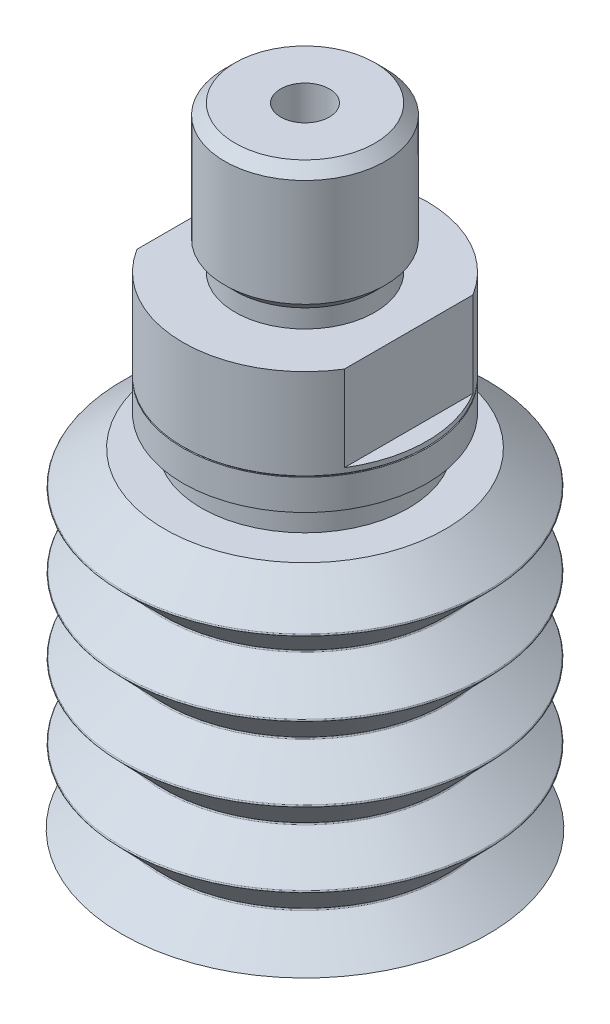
ISO-10303-21;
HEADER;
FILE_DESCRIPTION(('STEP AP214'),'2;1');
FILE_NAME('part.step','',(''),(''),'','','');
FILE_SCHEMA(('AUTOMOTIVE_DESIGN { 1 0 10303 214 1 1 1 1 }'));
ENDSEC;
DATA;
#1=APPLICATION_CONTEXT('core data for automotive mechanical design processes');
#2=APPLICATION_PROTOCOL_DEFINITION('international standard','automotive_design',2000,#1);
#3=PRODUCT_CONTEXT('',#1,'mechanical');
#4=PRODUCT('Part','Part','',(#3));
#5=PRODUCT_RELATED_PRODUCT_CATEGORY('part','',(#4));
#6=PRODUCT_DEFINITION_FORMATION('','',#4);
#7=PRODUCT_DEFINITION_CONTEXT('part definition',#1,'design');
#8=PRODUCT_DEFINITION('design','',#6,#7);
#9=PRODUCT_DEFINITION_SHAPE('','',#8);
#10=(LENGTH_UNIT() NAMED_UNIT(*) SI_UNIT(.MILLI.,.METRE.));
#11=(NAMED_UNIT(*) PLANE_ANGLE_UNIT() SI_UNIT($,.RADIAN.));
#12=(NAMED_UNIT(*) SI_UNIT($,.STERADIAN.) SOLID_ANGLE_UNIT());
#13=UNCERTAINTY_MEASURE_WITH_UNIT(LENGTH_MEASURE(1.E-05),#10,'distance_accuracy_value','');
#14=(GEOMETRIC_REPRESENTATION_CONTEXT(3) GLOBAL_UNCERTAINTY_ASSIGNED_CONTEXT((#13)) GLOBAL_UNIT_ASSIGNED_CONTEXT((#10,
#11,#12)) REPRESENTATION_CONTEXT('',''));
#15=CARTESIAN_POINT('',(0.,0.,0.));
#16=DIRECTION('',(0.,0.,1.));
#17=DIRECTION('',(1.,0.,0.));
#18=AXIS2_PLACEMENT_3D('',#15,#16,#17);
#19=CARTESIAN_POINT('',(-8.5,39.5,-12.));
#20=DIRECTION('',(1.,0.,0.));
#21=DIRECTION('',(0.,1.,0.));
#22=AXIS2_PLACEMENT_3D('',#19,#20,#21);
#23=PLANE('',#22);
#24=DIRECTION('',(0.,1.,0.));
#25=VECTOR('',#24,1.);
#26=CARTESIAN_POINT('',(-8.5,32.,5.26782687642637));
#27=LINE('',#26,#25);
#28=CARTESIAN_POINT('',(-8.5,32.5,5.26782687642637));
#29=VERTEX_POINT('',#28);
#30=CARTESIAN_POINT('',(-8.5,39.5,5.26782687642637));
#31=VERTEX_POINT('',#30);
#32=EDGE_CURVE('E336',#29,#31,#27,.T.);
#33=ORIENTED_EDGE('',*,*,#32,.T.);
#34=DIRECTION('',(0.,0.,-1.));
#35=VECTOR('',#34,1.);
#36=CARTESIAN_POINT('',(-8.5,39.5,0.));
#37=LINE('',#36,#35);
#38=CARTESIAN_POINT('',(-8.5,39.5,-5.26782687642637));
#39=VERTEX_POINT('',#38);
#40=EDGE_CURVE('E381',#31,#39,#37,.T.);
#41=ORIENTED_EDGE('',*,*,#40,.T.);
#42=DIRECTION('',(0.,-1.,0.));
#43=VECTOR('',#42,1.);
#44=CARTESIAN_POINT('',(-8.5,32.,-5.26782687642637));
#45=LINE('',#44,#43);
#46=CARTESIAN_POINT('',(-8.5,32.5,-5.26782687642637));
#47=VERTEX_POINT('',#46);
#48=EDGE_CURVE('E359',#39,#47,#45,.T.);
#49=ORIENTED_EDGE('',*,*,#48,.T.);
#50=DIRECTION('',(0.,0.,1.));
#51=VECTOR('',#50,1.);
#52=CARTESIAN_POINT('',(-8.5,32.5,-12.));
#53=LINE('',#52,#51);
#54=EDGE_CURVE('E10',#47,#29,#53,.T.);
#55=ORIENTED_EDGE('',*,*,#54,.T.);
#56=EDGE_LOOP('',(#33,#41,#49,#55));
#57=FACE_BOUND('',#56,.T.);
#58=ADVANCED_FACE('F16',(#57),#23,.F.);
#59=CARTESIAN_POINT('',(0.,32.5,0.));
#60=DIRECTION('',(0.,1.,0.));
#61=DIRECTION('',(1.,0.,0.));
#62=AXIS2_PLACEMENT_3D('',#59,#60,#61);
#63=PLANE('',#62);
#64=ORIENTED_EDGE('',*,*,#54,.F.);
#65=CARTESIAN_POINT('',(0.,32.5,0.));
#66=DIRECTION('',(0.,-1.,0.));
#67=DIRECTION('',(0.,0.,1.));
#68=AXIS2_PLACEMENT_3D('',#65,#66,#67);
#69=CIRCLE('',#68,10.);
#70=EDGE_CURVE('E340',#29,#47,#69,.T.);
#71=ORIENTED_EDGE('',*,*,#70,.F.);
#72=EDGE_LOOP('',(#64,#71));
#73=FACE_BOUND('',#72,.T.);
#74=ADVANCED_FACE('F525',(#73),#63,.T.);
#75=CARTESIAN_POINT('',(0.,32.5,0.));
#76=DIRECTION('',(0.,1.,0.));
#77=DIRECTION('',(1.,0.,0.));
#78=AXIS2_PLACEMENT_3D('',#75,#76,#77);
#79=PLANE('',#78);
#80=DIRECTION('',(0.,0.,-1.));
#81=VECTOR('',#80,1.);
#82=CARTESIAN_POINT('',(8.5,32.5,12.));
#83=LINE('',#82,#81);
#84=CARTESIAN_POINT('',(8.5,32.5,5.26782687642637));
#85=VERTEX_POINT('',#84);
#86=CARTESIAN_POINT('',(8.5,32.5,-5.26782687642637));
#87=VERTEX_POINT('',#86);
#88=EDGE_CURVE('E26',#85,#87,#83,.T.);
#89=ORIENTED_EDGE('',*,*,#88,.F.);
#90=CARTESIAN_POINT('',(0.,32.5,0.));
#91=DIRECTION('',(0.,-1.,0.));
#92=DIRECTION('',(0.,0.,1.));
#93=AXIS2_PLACEMENT_3D('',#90,#91,#92);
#94=CIRCLE('',#93,10.);
#95=EDGE_CURVE('E314',#87,#85,#94,.T.);
#96=ORIENTED_EDGE('',*,*,#95,.F.);
#97=EDGE_LOOP('',(#89,#96));
#98=FACE_BOUND('',#97,.T.);
#99=ADVANCED_FACE('F530',(#98),#79,.T.);
#100=CARTESIAN_POINT('',(8.5,39.5,12.));
#101=DIRECTION('',(-1.,0.,0.));
#102=DIRECTION('',(0.,0.,1.));
#103=AXIS2_PLACEMENT_3D('',#100,#101,#102);
#104=PLANE('',#103);
#105=DIRECTION('',(0.,1.,0.));
#106=VECTOR('',#105,1.);
#107=CARTESIAN_POINT('',(8.5,32.,-5.26782687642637));
#108=LINE('',#107,#106);
#109=CARTESIAN_POINT('',(8.5,39.5,-5.26782687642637));
#110=VERTEX_POINT('',#109);
#111=EDGE_CURVE('E384',#87,#110,#108,.T.);
#112=ORIENTED_EDGE('',*,*,#111,.T.);
#113=DIRECTION('',(0.,0.,1.));
#114=VECTOR('',#113,1.);
#115=CARTESIAN_POINT('',(8.5,39.5,0.));
#116=LINE('',#115,#114);
#117=CARTESIAN_POINT('',(8.5,39.5,5.26782687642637));
#118=VERTEX_POINT('',#117);
#119=EDGE_CURVE('E291',#110,#118,#116,.T.);
#120=ORIENTED_EDGE('',*,*,#119,.T.);
#121=DIRECTION('',(0.,-1.,0.));
#122=VECTOR('',#121,1.);
#123=CARTESIAN_POINT('',(8.5,32.,5.26782687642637));
#124=LINE('',#123,#122);
#125=EDGE_CURVE('E309',#118,#85,#124,.T.);
#126=ORIENTED_EDGE('',*,*,#125,.T.);
#127=ORIENTED_EDGE('',*,*,#88,.T.);
#128=EDGE_LOOP('',(#112,#120,#126,#127));
#129=FACE_BOUND('',#128,.T.);
#130=ADVANCED_FACE('F614',(#129),#104,.F.);
#131=CARTESIAN_POINT('',(0.,50.644,0.));
#132=DIRECTION('',(0.,-1.,0.));
#133=DIRECTION('',(0.,0.,-1.));
#134=AXIS2_PLACEMENT_3D('',#131,#132,#133);
#135=CONICAL_SURFACE('',#134,6.5785,0.785398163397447);
#136=CARTESIAN_POINT('',(0.,50.644,0.));
#137=DIRECTION('',(0.,-1.,0.));
#138=DIRECTION('',(0.,0.,-1.));
#139=AXIS2_PLACEMENT_3D('',#136,#137,#138);
#140=CIRCLE('',#139,6.5785);
#141=CARTESIAN_POINT('',(0.,50.644,-6.5785));
#142=VERTEX_POINT('',#141);
#143=EDGE_CURVE('E38',#142,#142,#140,.T.);
#144=ORIENTED_EDGE('',*,*,#143,.F.);
#145=EDGE_LOOP('',(#144));
#146=FACE_BOUND('',#145,.T.);
#147=CARTESIAN_POINT('',(0.,51.5,0.));
#148=DIRECTION('',(0.,-1.,0.));
#149=DIRECTION('',(0.,0.,-1.));
#150=AXIS2_PLACEMENT_3D('',#147,#148,#149);
#151=CIRCLE('',#150,5.7225);
#152=CARTESIAN_POINT('',(0.,51.5,-5.7225));
#153=VERTEX_POINT('',#152);
#154=EDGE_CURVE('E370',#153,#153,#151,.T.);
#155=ORIENTED_EDGE('',*,*,#154,.T.);
#156=EDGE_LOOP('',(#155));
#157=FACE_BOUND('',#156,.T.);
#158=ADVANCED_FACE('F616',(#146,#157),#135,.T.);
#159=CARTESIAN_POINT('',(0.,32.,0.));
#160=DIRECTION('',(0.,-1.,0.));
#161=DIRECTION('',(0.,0.,-1.));
#162=AXIS2_PLACEMENT_3D('',#159,#160,#161);
#163=CYLINDRICAL_SURFACE('',#162,6.5785);
#164=CARTESIAN_POINT('',(0.,41.856,0.));
#165=DIRECTION('',(0.,-1.,0.));
#166=DIRECTION('',(0.,0.,-1.));
#167=AXIS2_PLACEMENT_3D('',#164,#165,#166);
#168=CIRCLE('',#167,6.5785);
#169=CARTESIAN_POINT('',(0.,41.856,-6.5785));
#170=VERTEX_POINT('',#169);
#171=EDGE_CURVE('E290',#170,#170,#168,.T.);
#172=ORIENTED_EDGE('',*,*,#171,.F.);
#173=EDGE_LOOP('',(#172));
#174=FACE_BOUND('',#173,.T.);
#175=ORIENTED_EDGE('',*,*,#143,.T.);
#176=EDGE_LOOP('',(#175));
#177=FACE_BOUND('',#176,.T.);
#178=ADVANCED_FACE('F620',(#174,#177),#163,.T.);
#179=CARTESIAN_POINT('',(0.,41.,0.));
#180=DIRECTION('',(0.,1.,0.));
#181=DIRECTION('',(0.,0.,1.));
#182=AXIS2_PLACEMENT_3D('',#179,#180,#181);
#183=CONICAL_SURFACE('',#182,5.7225,0.785398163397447);
#184=CARTESIAN_POINT('',(0.,41.,0.));
#185=DIRECTION('',(0.,-1.,0.));
#186=DIRECTION('',(0.,0.,-1.));
#187=AXIS2_PLACEMENT_3D('',#184,#185,#186);
#188=CIRCLE('',#187,5.7225);
#189=CARTESIAN_POINT('',(0.,41.,-5.7225));
#190=VERTEX_POINT('',#189);
#191=EDGE_CURVE('E78',#190,#190,#188,.T.);
#192=ORIENTED_EDGE('',*,*,#191,.F.);
#193=EDGE_LOOP('',(#192));
#194=FACE_BOUND('',#193,.T.);
#195=ORIENTED_EDGE('',*,*,#171,.T.);
#196=EDGE_LOOP('',(#195));
#197=FACE_BOUND('',#196,.T.);
#198=ADVANCED_FACE('F587',(#194,#197),#183,.T.);
#199=CARTESIAN_POINT('',(0.,32.,0.));
#200=DIRECTION('',(0.,-1.,0.));
#201=DIRECTION('',(0.,0.,-1.));
#202=AXIS2_PLACEMENT_3D('',#199,#200,#201);
#203=CYLINDRICAL_SURFACE('',#202,5.7225);
#204=CARTESIAN_POINT('',(0.,39.5,0.));
#205=DIRECTION('',(0.,-1.,0.));
#206=DIRECTION('',(0.,0.,-1.));
#207=AXIS2_PLACEMENT_3D('',#204,#205,#206);
#208=CIRCLE('',#207,5.7225);
#209=CARTESIAN_POINT('',(0.,39.5,-5.7225));
#210=VERTEX_POINT('',#209);
#211=EDGE_CURVE('E88',#210,#210,#208,.T.);
#212=ORIENTED_EDGE('',*,*,#211,.F.);
#213=EDGE_LOOP('',(#212));
#214=FACE_BOUND('',#213,.T.);
#215=ORIENTED_EDGE('',*,*,#191,.T.);
#216=EDGE_LOOP('',(#215));
#217=FACE_BOUND('',#216,.T.);
#218=ADVANCED_FACE('F584',(#214,#217),#203,.T.);
#219=CARTESIAN_POINT('',(10.,39.5,0.));
#220=DIRECTION('',(0.,1.,0.));
#221=DIRECTION('',(1.,0.,0.));
#222=AXIS2_PLACEMENT_3D('',#219,#220,#221);
#223=PLANE('',#222);
#224=ORIENTED_EDGE('',*,*,#40,.F.);
#225=CARTESIAN_POINT('',(0.,39.5,0.));
#226=DIRECTION('',(0.,-1.,0.));
#227=DIRECTION('',(0.,0.,-1.));
#228=AXIS2_PLACEMENT_3D('',#225,#226,#227);
#229=CIRCLE('',#228,10.);
#230=EDGE_CURVE('E313',#118,#31,#229,.T.);
#231=ORIENTED_EDGE('',*,*,#230,.F.);
#232=ORIENTED_EDGE('',*,*,#119,.F.);
#233=CARTESIAN_POINT('',(0.,39.5,0.));
#234=DIRECTION('',(0.,-1.,0.));
#235=DIRECTION('',(0.,0.,-1.));
#236=AXIS2_PLACEMENT_3D('',#233,#234,#235);
#237=CIRCLE('',#236,10.);
#238=EDGE_CURVE('E363',#39,#110,#237,.T.);
#239=ORIENTED_EDGE('',*,*,#238,.F.);
#240=EDGE_LOOP('',(#224,#231,#232,#239));
#241=FACE_BOUND('',#240,.T.);
#242=ORIENTED_EDGE('',*,*,#211,.T.);
#243=EDGE_LOOP('',(#242));
#244=FACE_BOUND('',#243,.T.);
#245=ADVANCED_FACE('F544',(#241,#244),#223,.T.);
#246=CARTESIAN_POINT('',(0.,32.,0.));
#247=DIRECTION('',(0.,-1.,0.));
#248=DIRECTION('',(0.,0.,-1.));
#249=AXIS2_PLACEMENT_3D('',#246,#247,#248);
#250=CYLINDRICAL_SURFACE('',#249,10.);
#251=CARTESIAN_POINT('',(0.,32.1,0.));
#252=DIRECTION('',(0.,-1.,0.));
#253=DIRECTION('',(0.,0.,-1.));
#254=AXIS2_PLACEMENT_3D('',#251,#252,#253);
#255=CIRCLE('',#254,10.);
#256=CARTESIAN_POINT('',(0.,32.1,-10.));
#257=VERTEX_POINT('',#256);
#258=EDGE_CURVE('E388',#257,#257,#255,.T.);
#259=ORIENTED_EDGE('',*,*,#258,.F.);
#260=EDGE_LOOP('',(#259));
#261=FACE_BOUND('',#260,.T.);
#262=ORIENTED_EDGE('',*,*,#111,.F.);
#263=ORIENTED_EDGE('',*,*,#95,.T.);
#264=ORIENTED_EDGE('',*,*,#125,.F.);
#265=ORIENTED_EDGE('',*,*,#230,.T.);
#266=ORIENTED_EDGE('',*,*,#32,.F.);
#267=ORIENTED_EDGE('',*,*,#70,.T.);
#268=ORIENTED_EDGE('',*,*,#48,.F.);
#269=ORIENTED_EDGE('',*,*,#238,.T.);
#270=EDGE_LOOP('',(#262,#263,#264,#265,#266,#267,#268,#269));
#271=FACE_BOUND('',#270,.T.);
#272=ADVANCED_FACE('F541',(#261,#271),#250,.T.);
#273=CARTESIAN_POINT('',(0.,32.,0.));
#274=DIRECTION('',(0.,1.,0.));
#275=DIRECTION('',(0.,0.,1.));
#276=AXIS2_PLACEMENT_3D('',#273,#274,#275);
#277=CONICAL_SURFACE('',#276,9.9,0.785398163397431);
#278=CARTESIAN_POINT('',(0.,32.,0.));
#279=DIRECTION('',(0.,-1.,0.));
#280=DIRECTION('',(0.,0.,-1.));
#281=AXIS2_PLACEMENT_3D('',#278,#279,#280);
#282=CIRCLE('',#281,9.9);
#283=CARTESIAN_POINT('',(0.,32.,-9.9));
#284=VERTEX_POINT('',#283);
#285=EDGE_CURVE('E305',#284,#284,#282,.T.);
#286=ORIENTED_EDGE('',*,*,#285,.F.);
#287=EDGE_LOOP('',(#286));
#288=FACE_BOUND('',#287,.T.);
#289=ORIENTED_EDGE('',*,*,#258,.T.);
#290=EDGE_LOOP('',(#289));
#291=FACE_BOUND('',#290,.T.);
#292=ADVANCED_FACE('F660',(#288,#291),#277,.T.);
#293=CARTESIAN_POINT('',(0.,32.,0.));
#294=DIRECTION('',(0.,-1.,0.));
#295=DIRECTION('',(0.,0.,-1.));
#296=AXIS2_PLACEMENT_3D('',#293,#294,#295);
#297=CYLINDRICAL_SURFACE('',#296,2.);
#298=CARTESIAN_POINT('',(0.,51.5,0.));
#299=DIRECTION('',(0.,-1.,0.));
#300=DIRECTION('',(0.,0.,-1.));
#301=AXIS2_PLACEMENT_3D('',#298,#299,#300);
#302=CIRCLE('',#301,2.);
#303=CARTESIAN_POINT('',(0.,51.5,-2.));
#304=VERTEX_POINT('',#303);
#305=EDGE_CURVE('E331',#304,#304,#302,.T.);
#306=ORIENTED_EDGE('',*,*,#305,.F.);
#307=EDGE_LOOP('',(#306));
#308=FACE_BOUND('',#307,.T.);
#309=CARTESIAN_POINT('',(0.,32.,0.));
#310=DIRECTION('',(0.,-1.,0.));
#311=DIRECTION('',(0.,0.,-1.));
#312=AXIS2_PLACEMENT_3D('',#309,#310,#311);
#313=CIRCLE('',#312,2.);
#314=CARTESIAN_POINT('',(0.,32.,-2.));
#315=VERTEX_POINT('',#314);
#316=EDGE_CURVE('E328',#315,#315,#313,.T.);
#317=ORIENTED_EDGE('',*,*,#316,.T.);
#318=EDGE_LOOP('',(#317));
#319=FACE_BOUND('',#318,.T.);
#320=ADVANCED_FACE('F663',(#308,#319),#297,.F.);
#321=CARTESIAN_POINT('',(5.7225,51.5,0.));
#322=DIRECTION('',(0.,1.,0.));
#323=DIRECTION('',(1.,0.,0.));
#324=AXIS2_PLACEMENT_3D('',#321,#322,#323);
#325=PLANE('',#324);
#326=ORIENTED_EDGE('',*,*,#154,.F.);
#327=EDGE_LOOP('',(#326));
#328=FACE_BOUND('',#327,.T.);
#329=ORIENTED_EDGE('',*,*,#305,.T.);
#330=EDGE_LOOP('',(#329));
#331=FACE_BOUND('',#330,.T.);
#332=ADVANCED_FACE('F643',(#328,#331),#325,.T.);
#333=CARTESIAN_POINT('',(2.,32.,0.));
#334=DIRECTION('',(0.,-1.,0.));
#335=DIRECTION('',(0.,0.,-1.));
#336=AXIS2_PLACEMENT_3D('',#333,#334,#335);
#337=PLANE('',#336);
#338=ORIENTED_EDGE('',*,*,#316,.F.);
#339=EDGE_LOOP('',(#338));
#340=FACE_BOUND('',#339,.T.);
#341=CARTESIAN_POINT('',(0.,32.,0.));
#342=DIRECTION('',(0.,-1.,0.));
#343=DIRECTION('',(0.,0.,-1.));
#344=AXIS2_PLACEMENT_3D('',#341,#342,#343);
#345=CIRCLE('',#344,3.25);
#346=CARTESIAN_POINT('',(0.,32.,-3.25));
#347=VERTEX_POINT('',#346);
#348=EDGE_CURVE('E308',#347,#347,#345,.T.);
#349=ORIENTED_EDGE('',*,*,#348,.T.);
#350=EDGE_LOOP('',(#349));
#351=FACE_BOUND('',#350,.T.);
#352=ADVANCED_FACE('F442',(#340,#351),#337,.T.);
#353=CARTESIAN_POINT('',(0.,0.,0.));
#354=DIRECTION('',(0.,-1.,0.));
#355=DIRECTION('',(0.,0.,-1.));
#356=AXIS2_PLACEMENT_3D('',#353,#354,#355);
#357=CYLINDRICAL_SURFACE('',#356,3.25);
#358=ORIENTED_EDGE('',*,*,#348,.F.);
#359=EDGE_LOOP('',(#358));
#360=FACE_BOUND('',#359,.T.);
#361=CARTESIAN_POINT('',(0.,29.5,0.));
#362=DIRECTION('',(0.,-1.,0.));
#363=DIRECTION('',(0.,0.,-1.));
#364=AXIS2_PLACEMENT_3D('',#361,#362,#363);
#365=CIRCLE('',#364,3.25);
#366=CARTESIAN_POINT('',(0.,29.5,-3.25));
#367=VERTEX_POINT('',#366);
#368=EDGE_CURVE('E322',#367,#367,#365,.T.);
#369=ORIENTED_EDGE('',*,*,#368,.T.);
#370=EDGE_LOOP('',(#369));
#371=FACE_BOUND('',#370,.T.);
#372=ADVANCED_FACE('F444',(#360,#371),#357,.F.);
#373=CARTESIAN_POINT('',(10.,32.,0.));
#374=DIRECTION('',(0.,1.,0.));
#375=DIRECTION('',(1.,0.,0.));
#376=AXIS2_PLACEMENT_3D('',#373,#374,#375);
#377=PLANE('',#376);
#378=CARTESIAN_POINT('',(0.,32.,0.));
#379=DIRECTION('',(0.,-1.,0.));
#380=DIRECTION('',(0.,0.,-1.));
#381=AXIS2_PLACEMENT_3D('',#378,#379,#380);
#382=CIRCLE('',#381,10.);
#383=CARTESIAN_POINT('',(0.,32.,-10.));
#384=VERTEX_POINT('',#383);
#385=EDGE_CURVE('E303',#384,#384,#382,.T.);
#386=ORIENTED_EDGE('',*,*,#385,.F.);
#387=EDGE_LOOP('',(#386));
#388=FACE_BOUND('',#387,.T.);
#389=ORIENTED_EDGE('',*,*,#285,.T.);
#390=EDGE_LOOP('',(#389));
#391=FACE_BOUND('',#390,.T.);
#392=ADVANCED_FACE('F447',(#388,#391),#377,.T.);
#393=CARTESIAN_POINT('',(0.,0.,0.));
#394=DIRECTION('',(0.,-1.,0.));
#395=DIRECTION('',(0.,0.,-1.));
#396=AXIS2_PLACEMENT_3D('',#393,#394,#395);
#397=CYLINDRICAL_SURFACE('',#396,10.);
#398=CARTESIAN_POINT('',(0.,29.5,0.));
#399=DIRECTION('',(0.,-1.,0.));
#400=DIRECTION('',(0.,0.,-1.));
#401=AXIS2_PLACEMENT_3D('',#398,#399,#400);
#402=CIRCLE('',#401,10.);
#403=CARTESIAN_POINT('',(0.,29.5,-10.));
#404=VERTEX_POINT('',#403);
#405=EDGE_CURVE('E300',#404,#404,#402,.T.);
#406=ORIENTED_EDGE('',*,*,#405,.F.);
#407=EDGE_LOOP('',(#406));
#408=FACE_BOUND('',#407,.T.);
#409=ORIENTED_EDGE('',*,*,#385,.T.);
#410=EDGE_LOOP('',(#409));
#411=FACE_BOUND('',#410,.T.);
#412=ADVANCED_FACE('F649',(#408,#411),#397,.T.);
#413=CARTESIAN_POINT('',(8.5,29.5,0.));
#414=DIRECTION('',(0.,-1.,0.));
#415=DIRECTION('',(0.,0.,-1.));
#416=AXIS2_PLACEMENT_3D('',#413,#414,#415);
#417=PLANE('',#416);
#418=CARTESIAN_POINT('',(0.,29.5,0.));
#419=DIRECTION('',(0.,-1.,0.));
#420=DIRECTION('',(0.,0.,-1.));
#421=AXIS2_PLACEMENT_3D('',#418,#419,#420);
#422=CIRCLE('',#421,8.5);
#423=CARTESIAN_POINT('',(0.,29.5,-8.5));
#424=VERTEX_POINT('',#423);
#425=EDGE_CURVE('E304',#424,#424,#422,.T.);
#426=ORIENTED_EDGE('',*,*,#425,.F.);
#427=EDGE_LOOP('',(#426));
#428=FACE_BOUND('',#427,.T.);
#429=ORIENTED_EDGE('',*,*,#405,.T.);
#430=EDGE_LOOP('',(#429));
#431=FACE_BOUND('',#430,.T.);
#432=ADVANCED_FACE('F645',(#428,#431),#417,.T.);
#433=CARTESIAN_POINT('',(0.,0.,0.));
#434=DIRECTION('',(0.,-1.,0.));
#435=DIRECTION('',(0.,0.,-1.));
#436=AXIS2_PLACEMENT_3D('',#433,#434,#435);
#437=CYLINDRICAL_SURFACE('',#436,8.5);
#438=CARTESIAN_POINT('',(0.,27.,0.));
#439=DIRECTION('',(0.,-1.,0.));
#440=DIRECTION('',(0.,0.,-1.));
#441=AXIS2_PLACEMENT_3D('',#438,#439,#440);
#442=CIRCLE('',#441,8.5);
#443=CARTESIAN_POINT('',(0.,27.,-8.5));
#444=VERTEX_POINT('',#443);
#445=EDGE_CURVE('E352',#444,#444,#442,.T.);
#446=ORIENTED_EDGE('',*,*,#445,.F.);
#447=EDGE_LOOP('',(#446));
#448=FACE_BOUND('',#447,.T.);
#449=ORIENTED_EDGE('',*,*,#425,.T.);
#450=EDGE_LOOP('',(#449));
#451=FACE_BOUND('',#450,.T.);
#452=ADVANCED_FACE('F648',(#448,#451),#437,.T.);
#453=CARTESIAN_POINT('',(11.5,27.,0.));
#454=DIRECTION('',(0.,1.,0.));
#455=DIRECTION('',(1.,0.,0.));
#456=AXIS2_PLACEMENT_3D('',#453,#454,#455);
#457=PLANE('',#456);
#458=CARTESIAN_POINT('',(0.,27.,0.));
#459=DIRECTION('',(0.,-1.,0.));
#460=DIRECTION('',(0.,0.,-1.));
#461=AXIS2_PLACEMENT_3D('',#458,#459,#460);
#462=CIRCLE('',#461,11.5);
#463=CARTESIAN_POINT('',(0.,27.,-11.5));
#464=VERTEX_POINT('',#463);
#465=EDGE_CURVE('E354',#464,#464,#462,.T.);
#466=ORIENTED_EDGE('',*,*,#465,.F.);
#467=EDGE_LOOP('',(#466));
#468=FACE_BOUND('',#467,.T.);
#469=ORIENTED_EDGE('',*,*,#445,.T.);
#470=EDGE_LOOP('',(#469));
#471=FACE_BOUND('',#470,.T.);
#472=ADVANCED_FACE('F671',(#468,#471),#457,.T.);
#473=CARTESIAN_POINT('',(0.,24.3508730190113,0.));
#474=DIRECTION('',(0.,-1.,0.));
#475=DIRECTION('',(0.,0.,-1.));
#476=AXIS2_PLACEMENT_3D('',#473,#474,#475);
#477=CONICAL_SURFACE('',#476,14.9104822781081,0.910387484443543);
#478=CARTESIAN_POINT('',(0.,24.3508730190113,0.));
#479=DIRECTION('',(0.,-1.,0.));
#480=DIRECTION('',(0.,0.,-1.));
#481=AXIS2_PLACEMENT_3D('',#478,#479,#480);
#482=CIRCLE('',#481,14.9104822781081);
#483=CARTESIAN_POINT('',(0.,24.3508730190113,-14.9104822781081));
#484=VERTEX_POINT('',#483);
#485=EDGE_CURVE('E344',#484,#484,#482,.T.);
#486=ORIENTED_EDGE('',*,*,#485,.F.);
#487=EDGE_LOOP('',(#486));
#488=FACE_BOUND('',#487,.T.);
#489=ORIENTED_EDGE('',*,*,#465,.T.);
#490=EDGE_LOOP('',(#489));
#491=FACE_BOUND('',#490,.T.);
#492=ADVANCED_FACE('F674',(#488,#491),#477,.T.);
#493=CARTESIAN_POINT('',(0.,24.2718988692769,0.));
#494=DIRECTION('',(0.,-1.,0.));
#495=DIRECTION('',(0.,0.,-1.));
#496=AXIS2_PLACEMENT_3D('',#493,#494,#495);
#497=TOROIDAL_SURFACE('',#496,14.8491382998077,0.099999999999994);
#498=CARTESIAN_POINT('',(0.,24.2011881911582,0.));
#499=DIRECTION('',(0.,-1.,0.));
#500=DIRECTION('',(0.,0.,-1.));
#501=AXIS2_PLACEMENT_3D('',#498,#499,#500);
#502=CIRCLE('',#501,14.9198489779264);
#503=CARTESIAN_POINT('',(0.,24.2011881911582,-14.9198489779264));
#504=VERTEX_POINT('',#503);
#505=EDGE_CURVE('E341',#504,#504,#502,.T.);
#506=ORIENTED_EDGE('',*,*,#505,.F.);
#507=EDGE_LOOP('',(#506));
#508=FACE_BOUND('',#507,.T.);
#509=ORIENTED_EDGE('',*,*,#485,.T.);
#510=EDGE_LOOP('',(#509));
#511=FACE_BOUND('',#510,.T.);
#512=ADVANCED_FACE('F573',(#508,#511),#497,.T.);
#513=CARTESIAN_POINT('',(0.,20.8564895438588,0.));
#514=DIRECTION('',(0.,1.,0.));
#515=DIRECTION('',(0.,0.,1.));
#516=AXIS2_PLACEMENT_3D('',#513,#514,#515);
#517=CONICAL_SURFACE('',#516,11.575150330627,0.785398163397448);
#518=CARTESIAN_POINT('',(0.,20.8564895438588,0.));
#519=DIRECTION('',(0.,-1.,0.));
#520=DIRECTION('',(0.,0.,-1.));
#521=AXIS2_PLACEMENT_3D('',#518,#519,#520);
#522=CIRCLE('',#521,11.575150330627);
#523=CARTESIAN_POINT('',(0.,20.8564895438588,-11.575150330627));
#524=VERTEX_POINT('',#523);
#525=EDGE_CURVE('E345',#524,#524,#522,.T.);
#526=ORIENTED_EDGE('',*,*,#525,.F.);
#527=EDGE_LOOP('',(#526));
#528=FACE_BOUND('',#527,.T.);
#529=ORIENTED_EDGE('',*,*,#505,.T.);
#530=EDGE_LOOP('',(#529));
#531=FACE_BOUND('',#530,.T.);
#532=ADVANCED_FACE('F563',(#528,#531),#517,.T.);
#533=CARTESIAN_POINT('',(0.,20.7857788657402,0.));
#534=DIRECTION('',(0.,-1.,0.));
#535=DIRECTION('',(0.,0.,-1.));
#536=AXIS2_PLACEMENT_3D('',#533,#534,#535);
#537=TOROIDAL_SURFACE('',#536,11.6458610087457,0.100000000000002);
#538=ORIENTED_EDGE('',*,*,#525,.T.);
#539=EDGE_LOOP('',(#538));
#540=FACE_BOUND('',#539,.T.);
#541=CARTESIAN_POINT('',(0.,20.7048771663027,0.));
#542=DIRECTION('',(0.,-1.,0.));
#543=DIRECTION('',(0.,0.,-1.));
#544=AXIS2_PLACEMENT_3D('',#541,#542,#543);
#545=CIRCLE('',#544,11.5870824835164);
#546=CARTESIAN_POINT('',(0.,20.7048771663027,-11.5870824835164));
#547=VERTEX_POINT('',#546);
#548=EDGE_CURVE('E378',#547,#547,#545,.T.);
#549=ORIENTED_EDGE('',*,*,#548,.F.);
#550=EDGE_LOOP('',(#549));
#551=FACE_BOUND('',#550,.T.);
#552=ADVANCED_FACE('F561',(#540,#551),#537,.F.);
#553=CARTESIAN_POINT('',(0.,18.2928644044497,0.));
#554=DIRECTION('',(0.,-1.,0.));
#555=DIRECTION('',(0.,0.,-1.));
#556=AXIS2_PLACEMENT_3D('',#553,#554,#555);
#557=CONICAL_SURFACE('',#556,14.9069332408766,0.942477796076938);
#558=CARTESIAN_POINT('',(0.,18.2928644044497,0.));
#559=DIRECTION('',(0.,-1.,0.));
#560=DIRECTION('',(0.,0.,-1.));
#561=AXIS2_PLACEMENT_3D('',#558,#559,#560);
#562=CIRCLE('',#561,14.9069332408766);
#563=CARTESIAN_POINT('',(0.,18.2928644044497,-14.9069332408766));
#564=VERTEX_POINT('',#563);
#565=EDGE_CURVE('E389',#564,#564,#562,.T.);
#566=ORIENTED_EDGE('',*,*,#565,.F.);
#567=EDGE_LOOP('',(#566));
#568=FACE_BOUND('',#567,.T.);
#569=ORIENTED_EDGE('',*,*,#548,.T.);
#570=EDGE_LOOP('',(#569));
#571=FACE_BOUND('',#570,.T.);
#572=ADVANCED_FACE('F559',(#568,#571),#557,.T.);
#573=CARTESIAN_POINT('',(0.,18.2119627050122,0.));
#574=DIRECTION('',(0.,-1.,0.));
#575=DIRECTION('',(0.,0.,-1.));
#576=AXIS2_PLACEMENT_3D('',#573,#574,#575);
#577=TOROIDAL_SURFACE('',#576,14.8481547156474,0.0999999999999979);
#578=CARTESIAN_POINT('',(0.,18.1424968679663,0.));
#579=DIRECTION('',(0.,-1.,0.));
#580=DIRECTION('',(0.,0.,-1.));
#581=AXIS2_PLACEMENT_3D('',#578,#579,#580);
#582=CIRCLE('',#581,14.9200886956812);
#583=CARTESIAN_POINT('',(0.,18.1424968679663,-14.9200886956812));
#584=VERTEX_POINT('',#583);
#585=EDGE_CURVE('E271',#584,#584,#582,.T.);
#586=ORIENTED_EDGE('',*,*,#585,.F.);
#587=EDGE_LOOP('',(#586));
#588=FACE_BOUND('',#587,.T.);
#589=ORIENTED_EDGE('',*,*,#565,.T.);
#590=EDGE_LOOP('',(#589));
#591=FACE_BOUND('',#590,.T.);
#592=ADVANCED_FACE('F570',(#588,#591),#577,.T.);
#593=CARTESIAN_POINT('',(0.,14.6851152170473,0.));
#594=DIRECTION('',(0.,1.,0.));
#595=DIRECTION('',(0.,0.,1.));
#596=AXIS2_PLACEMENT_3D('',#593,#594,#595);
#597=CONICAL_SURFACE('',#596,11.5813340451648,0.767944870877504);
#598=CARTESIAN_POINT('',(0.,14.6851152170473,0.));
#599=DIRECTION('',(0.,-1.,0.));
#600=DIRECTION('',(0.,0.,-1.));
#601=AXIS2_PLACEMENT_3D('',#598,#599,#600);
#602=CIRCLE('',#601,11.5813340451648);
#603=CARTESIAN_POINT('',(0.,14.6851152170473,-11.5813340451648));
#604=VERTEX_POINT('',#603);
#605=EDGE_CURVE('E264',#604,#604,#602,.T.);
#606=ORIENTED_EDGE('',*,*,#605,.F.);
#607=EDGE_LOOP('',(#606));
#608=FACE_BOUND('',#607,.T.);
#609=ORIENTED_EDGE('',*,*,#585,.T.);
#610=EDGE_LOOP('',(#609));
#611=FACE_BOUND('',#610,.T.);
#612=ADVANCED_FACE('F655',(#608,#611),#597,.T.);
#613=CARTESIAN_POINT('',(0.,14.6156493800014,0.));
#614=DIRECTION('',(0.,-1.,0.));
#615=DIRECTION('',(0.,0.,-1.));
#616=AXIS2_PLACEMENT_3D('',#613,#614,#615);
#617=TOROIDAL_SURFACE('',#616,11.6532680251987,0.1);
#618=ORIENTED_EDGE('',*,*,#605,.T.);
#619=EDGE_LOOP('',(#618));
#620=FACE_BOUND('',#619,.T.);
#621=CARTESIAN_POINT('',(0.,14.5337341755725,0.));
#622=DIRECTION('',(0.,-1.,0.));
#623=DIRECTION('',(0.,0.,-1.));
#624=AXIS2_PLACEMENT_3D('',#621,#622,#623);
#625=CIRCLE('',#624,11.5959103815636);
#626=CARTESIAN_POINT('',(0.,14.5337341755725,-11.5959103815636));
#627=VERTEX_POINT('',#626);
#628=EDGE_CURVE('E19',#627,#627,#625,.T.);
#629=ORIENTED_EDGE('',*,*,#628,.F.);
#630=EDGE_LOOP('',(#629));
#631=FACE_BOUND('',#630,.T.);
#632=ADVANCED_FACE('F658',(#620,#631),#617,.F.);
#633=CARTESIAN_POINT('',(0.,12.2173221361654,0.));
#634=DIRECTION('',(0.,-1.,0.));
#635=DIRECTION('',(0.,0.,-1.));
#636=AXIS2_PLACEMENT_3D('',#633,#634,#635);
#637=CONICAL_SURFACE('',#636,14.9040896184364,0.959931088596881);
#638=CARTESIAN_POINT('',(0.,12.2173221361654,0.));
#639=DIRECTION('',(0.,-1.,0.));
#640=DIRECTION('',(0.,0.,-1.));
#641=AXIS2_PLACEMENT_3D('',#638,#639,#640);
#642=CIRCLE('',#641,14.9040896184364);
#643=CARTESIAN_POINT('',(0.,12.2173221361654,-14.9040896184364));
#644=VERTEX_POINT('',#643);
#645=EDGE_CURVE('E265',#644,#644,#642,.T.);
#646=ORIENTED_EDGE('',*,*,#645,.F.);
#647=EDGE_LOOP('',(#646));
#648=FACE_BOUND('',#647,.T.);
#649=ORIENTED_EDGE('',*,*,#628,.T.);
#650=EDGE_LOOP('',(#649));
#651=FACE_BOUND('',#650,.T.);
#652=ADVANCED_FACE('F261',(#648,#651),#637,.T.);
#653=CARTESIAN_POINT('',(0.,12.1354069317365,0.));
#654=DIRECTION('',(0.,-1.,0.));
#655=DIRECTION('',(0.,0.,-1.));
#656=AXIS2_PLACEMENT_3D('',#653,#654,#655);
#657=TOROIDAL_SURFACE('',#656,14.8467319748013,0.100000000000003);
#658=CARTESIAN_POINT('',(0.,12.0659410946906,0.));
#659=DIRECTION('',(0.,-1.,0.));
#660=DIRECTION('',(0.,0.,-1.));
#661=AXIS2_PLACEMENT_3D('',#658,#659,#660);
#662=CIRCLE('',#661,14.9186659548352);
#663=CARTESIAN_POINT('',(0.,12.0659410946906,-14.9186659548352));
#664=VERTEX_POINT('',#663);
#665=EDGE_CURVE('E274',#664,#664,#662,.T.);
#666=ORIENTED_EDGE('',*,*,#665,.F.);
#667=EDGE_LOOP('',(#666));
#668=FACE_BOUND('',#667,.T.);
#669=ORIENTED_EDGE('',*,*,#645,.T.);
#670=EDGE_LOOP('',(#669));
#671=FACE_BOUND('',#670,.T.);
#672=ADVANCED_FACE('F711',(#668,#671),#657,.T.);
#673=CARTESIAN_POINT('',(0.,8.61003273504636,0.));
#674=DIRECTION('',(0.,1.,0.));
#675=DIRECTION('',(0.,0.,1.));
#676=AXIS2_PLACEMENT_3D('',#673,#674,#675);
#677=CONICAL_SURFACE('',#676,11.5813340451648,0.767944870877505);
#678=CARTESIAN_POINT('',(0.,8.61003273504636,0.));
#679=DIRECTION('',(0.,-1.,0.));
#680=DIRECTION('',(0.,0.,-1.));
#681=AXIS2_PLACEMENT_3D('',#678,#679,#680);
#682=CIRCLE('',#681,11.5813340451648);
#683=CARTESIAN_POINT('',(0.,8.61003273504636,-11.5813340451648));
#684=VERTEX_POINT('',#683);
#685=EDGE_CURVE('E282',#684,#684,#682,.T.);
#686=ORIENTED_EDGE('',*,*,#685,.F.);
#687=EDGE_LOOP('',(#686));
#688=FACE_BOUND('',#687,.T.);
#689=ORIENTED_EDGE('',*,*,#665,.T.);
#690=EDGE_LOOP('',(#689));
#691=FACE_BOUND('',#690,.T.);
#692=ADVANCED_FACE('F708',(#688,#691),#677,.T.);
#693=CARTESIAN_POINT('',(0.,8.54056689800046,0.));
#694=DIRECTION('',(0.,-1.,0.));
#695=DIRECTION('',(0.,0.,-1.));
#696=AXIS2_PLACEMENT_3D('',#693,#694,#695);
#697=TOROIDAL_SURFACE('',#696,11.6532680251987,0.100000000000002);
#698=ORIENTED_EDGE('',*,*,#685,.T.);
#699=EDGE_LOOP('',(#698));
#700=FACE_BOUND('',#699,.T.);
#701=CARTESIAN_POINT('',(0.,8.45865169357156,0.));
#702=DIRECTION('',(0.,-1.,0.));
#703=DIRECTION('',(0.,0.,-1.));
#704=AXIS2_PLACEMENT_3D('',#701,#702,#703);
#705=CIRCLE('',#704,11.5959103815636);
#706=CARTESIAN_POINT('',(0.,8.45865169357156,-11.5959103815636));
#707=VERTEX_POINT('',#706);
#708=EDGE_CURVE('E375',#707,#707,#705,.T.);
#709=ORIENTED_EDGE('',*,*,#708,.F.);
#710=EDGE_LOOP('',(#709));
#711=FACE_BOUND('',#710,.T.);
#712=ADVANCED_FACE('F705',(#700,#711),#697,.F.);
#713=CARTESIAN_POINT('',(0.,6.14223965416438,0.));
#714=DIRECTION('',(0.,-1.,0.));
#715=DIRECTION('',(0.,0.,-1.));
#716=AXIS2_PLACEMENT_3D('',#713,#714,#715);
#717=CONICAL_SURFACE('',#716,14.9040896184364,0.959931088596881);
#718=CARTESIAN_POINT('',(0.,6.14223965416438,0.));
#719=DIRECTION('',(0.,-1.,0.));
#720=DIRECTION('',(0.,0.,-1.));
#721=AXIS2_PLACEMENT_3D('',#718,#719,#720);
#722=CIRCLE('',#721,14.9040896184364);
#723=CARTESIAN_POINT('',(0.,6.14223965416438,-14.9040896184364));
#724=VERTEX_POINT('',#723);
#725=EDGE_CURVE('E407',#724,#724,#722,.T.);
#726=ORIENTED_EDGE('',*,*,#725,.F.);
#727=EDGE_LOOP('',(#726));
#728=FACE_BOUND('',#727,.T.);
#729=ORIENTED_EDGE('',*,*,#708,.T.);
#730=EDGE_LOOP('',(#729));
#731=FACE_BOUND('',#730,.T.);
#732=ADVANCED_FACE('F577',(#728,#731),#717,.T.);
#733=CARTESIAN_POINT('',(0.,6.06032444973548,0.));
#734=DIRECTION('',(0.,-1.,0.));
#735=DIRECTION('',(0.,0.,-1.));
#736=AXIS2_PLACEMENT_3D('',#733,#734,#735);
#737=TOROIDAL_SURFACE('',#736,14.8467319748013,0.100000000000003);
#738=CARTESIAN_POINT('',(0.,5.99085861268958,0.));
#739=DIRECTION('',(0.,-1.,0.));
#740=DIRECTION('',(0.,0.,-1.));
#741=AXIS2_PLACEMENT_3D('',#738,#739,#740);
#742=CIRCLE('',#741,14.9186659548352);
#743=CARTESIAN_POINT('',(0.,5.99085861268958,-14.9186659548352));
#744=VERTEX_POINT('',#743);
#745=EDGE_CURVE('E318',#744,#744,#742,.T.);
#746=ORIENTED_EDGE('',*,*,#745,.F.);
#747=EDGE_LOOP('',(#746));
#748=FACE_BOUND('',#747,.T.);
#749=ORIENTED_EDGE('',*,*,#725,.T.);
#750=EDGE_LOOP('',(#749));
#751=FACE_BOUND('',#750,.T.);
#752=ADVANCED_FACE('F579',(#748,#751),#737,.T.);
#753=CARTESIAN_POINT('',(0.,2.53495025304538,0.));
#754=DIRECTION('',(0.,1.,0.));
#755=DIRECTION('',(0.,0.,1.));
#756=AXIS2_PLACEMENT_3D('',#753,#754,#755);
#757=CONICAL_SURFACE('',#756,11.5813340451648,0.767944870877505);
#758=CARTESIAN_POINT('',(0.,2.53495025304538,0.));
#759=DIRECTION('',(0.,-1.,0.));
#760=DIRECTION('',(0.,0.,-1.));
#761=AXIS2_PLACEMENT_3D('',#758,#759,#760);
#762=CIRCLE('',#761,11.5813340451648);
#763=CARTESIAN_POINT('',(0.,2.53495025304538,-11.5813340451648));
#764=VERTEX_POINT('',#763);
#765=EDGE_CURVE('E296',#764,#764,#762,.T.);
#766=ORIENTED_EDGE('',*,*,#765,.F.);
#767=EDGE_LOOP('',(#766));
#768=FACE_BOUND('',#767,.T.);
#769=ORIENTED_EDGE('',*,*,#745,.T.);
#770=EDGE_LOOP('',(#769));
#771=FACE_BOUND('',#770,.T.);
#772=ADVANCED_FACE('F582',(#768,#771),#757,.T.);
#773=CARTESIAN_POINT('',(0.,2.46548441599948,0.));
#774=DIRECTION('',(0.,-1.,0.));
#775=DIRECTION('',(0.,0.,-1.));
#776=AXIS2_PLACEMENT_3D('',#773,#774,#775);
#777=TOROIDAL_SURFACE('',#776,11.6532680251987,0.0999999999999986);
#778=ORIENTED_EDGE('',*,*,#765,.T.);
#779=EDGE_LOOP('',(#778));
#780=FACE_BOUND('',#779,.T.);
#781=CARTESIAN_POINT('',(0.,2.38356921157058,0.));
#782=DIRECTION('',(0.,-1.,0.));
#783=DIRECTION('',(0.,0.,-1.));
#784=AXIS2_PLACEMENT_3D('',#781,#782,#783);
#785=CIRCLE('',#784,11.5959103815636);
#786=CARTESIAN_POINT('',(0.,2.38356921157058,-11.5959103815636));
#787=VERTEX_POINT('',#786);
#788=EDGE_CURVE('E292',#787,#787,#785,.T.);
#789=ORIENTED_EDGE('',*,*,#788,.F.);
#790=EDGE_LOOP('',(#789));
#791=FACE_BOUND('',#790,.T.);
#792=ADVANCED_FACE('F593',(#780,#791),#777,.F.);
#793=CARTESIAN_POINT('',(0.,0.,0.));
#794=DIRECTION('',(0.,-1.,0.));
#795=DIRECTION('',(0.,0.,-1.));
#796=AXIS2_PLACEMENT_3D('',#793,#794,#795);
#797=CONICAL_SURFACE('',#796,15.,0.959931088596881);
#798=CARTESIAN_POINT('',(0.,0.,0.));
#799=DIRECTION('',(0.,-1.,0.));
#800=DIRECTION('',(0.,0.,-1.));
#801=AXIS2_PLACEMENT_3D('',#798,#799,#800);
#802=CIRCLE('',#801,15.);
#803=CARTESIAN_POINT('',(0.,0.,-15.));
#804=VERTEX_POINT('',#803);
#805=EDGE_CURVE('E297',#804,#804,#802,.T.);
#806=ORIENTED_EDGE('',*,*,#805,.F.);
#807=EDGE_LOOP('',(#806));
#808=FACE_BOUND('',#807,.T.);
#809=ORIENTED_EDGE('',*,*,#788,.T.);
#810=EDGE_LOOP('',(#809));
#811=FACE_BOUND('',#810,.T.);
#812=ADVANCED_FACE('F589',(#808,#811),#797,.T.);
#813=CARTESIAN_POINT('',(13.9467319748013,0.,0.));
#814=DIRECTION('',(0.,-1.,0.));
#815=DIRECTION('',(0.,0.,-1.));
#816=AXIS2_PLACEMENT_3D('',#813,#814,#815);
#817=PLANE('',#816);
#818=CARTESIAN_POINT('',(0.,0.,0.));
#819=DIRECTION('',(0.,-1.,0.));
#820=DIRECTION('',(0.,0.,-1.));
#821=AXIS2_PLACEMENT_3D('',#818,#819,#820);
#822=CIRCLE('',#821,13.9467319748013);
#823=CARTESIAN_POINT('',(0.,0.,-13.9467319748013));
#824=VERTEX_POINT('',#823);
#825=EDGE_CURVE('E437',#824,#824,#822,.T.);
#826=ORIENTED_EDGE('',*,*,#825,.F.);
#827=EDGE_LOOP('',(#826));
#828=FACE_BOUND('',#827,.T.);
#829=ORIENTED_EDGE('',*,*,#805,.T.);
#830=EDGE_LOOP('',(#829));
#831=FACE_BOUND('',#830,.T.);
#832=ADVANCED_FACE('F592',(#828,#831),#817,.T.);
#833=CARTESIAN_POINT('',(0.,2.38356921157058,0.));
#834=DIRECTION('',(0.,-1.,0.));
#835=DIRECTION('',(0.,0.,-1.));
#836=AXIS2_PLACEMENT_3D('',#833,#834,#835);
#837=CONICAL_SURFACE('',#836,10.5426423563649,0.959931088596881);
#838=CARTESIAN_POINT('',(0.,2.38356921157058,0.));
#839=DIRECTION('',(0.,-1.,0.));
#840=DIRECTION('',(0.,0.,-1.));
#841=AXIS2_PLACEMENT_3D('',#838,#839,#840);
#842=CIRCLE('',#841,10.5426423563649);
#843=CARTESIAN_POINT('',(0.,2.38356921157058,-10.5426423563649));
#844=VERTEX_POINT('',#843);
#845=EDGE_CURVE('E286',#844,#844,#842,.T.);
#846=ORIENTED_EDGE('',*,*,#845,.F.);
#847=EDGE_LOOP('',(#846));
#848=FACE_BOUND('',#847,.T.);
#849=ORIENTED_EDGE('',*,*,#825,.T.);
#850=EDGE_LOOP('',(#849));
#851=FACE_BOUND('',#850,.T.);
#852=ADVANCED_FACE('F606',(#848,#851),#837,.F.);
#853=CARTESIAN_POINT('',(0.,2.46548441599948,0.));
#854=DIRECTION('',(0.,-1.,0.));
#855=DIRECTION('',(0.,0.,-1.));
#856=AXIS2_PLACEMENT_3D('',#853,#854,#855);
#857=TOROIDAL_SURFACE('',#856,10.6,0.1);
#858=CARTESIAN_POINT('',(0.,2.53495025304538,0.));
#859=DIRECTION('',(0.,-1.,0.));
#860=DIRECTION('',(0.,0.,-1.));
#861=AXIS2_PLACEMENT_3D('',#858,#859,#860);
#862=CIRCLE('',#861,10.5280660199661);
#863=CARTESIAN_POINT('',(0.,2.53495025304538,-10.5280660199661));
#864=VERTEX_POINT('',#863);
#865=EDGE_CURVE('E749',#864,#864,#862,.T.);
#866=ORIENTED_EDGE('',*,*,#865,.F.);
#867=EDGE_LOOP('',(#866));
#868=FACE_BOUND('',#867,.T.);
#869=ORIENTED_EDGE('',*,*,#845,.T.);
#870=EDGE_LOOP('',(#869));
#871=FACE_BOUND('',#870,.T.);
#872=ADVANCED_FACE('F519',(#868,#871),#857,.T.);
#873=CARTESIAN_POINT('',(0.,5.99085861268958,0.));
#874=DIRECTION('',(0.,1.,0.));
#875=DIRECTION('',(0.,0.,1.));
#876=AXIS2_PLACEMENT_3D('',#873,#874,#875);
#877=CONICAL_SURFACE('',#876,13.8653979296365,0.767944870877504);
#878=CARTESIAN_POINT('',(0.,5.99085861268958,0.));
#879=DIRECTION('',(0.,-1.,0.));
#880=DIRECTION('',(0.,0.,-1.));
#881=AXIS2_PLACEMENT_3D('',#878,#879,#880);
#882=CIRCLE('',#881,13.8653979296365);
#883=CARTESIAN_POINT('',(0.,5.99085861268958,-13.8653979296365));
#884=VERTEX_POINT('',#883);
#885=EDGE_CURVE('E428',#884,#884,#882,.T.);
#886=ORIENTED_EDGE('',*,*,#885,.F.);
#887=EDGE_LOOP('',(#886));
#888=FACE_BOUND('',#887,.T.);
#889=ORIENTED_EDGE('',*,*,#865,.T.);
#890=EDGE_LOOP('',(#889));
#891=FACE_BOUND('',#890,.T.);
#892=ADVANCED_FACE('F512',(#888,#891),#877,.F.);
#893=CARTESIAN_POINT('',(0.,6.06032444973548,0.));
#894=DIRECTION('',(0.,-1.,0.));
#895=DIRECTION('',(0.,0.,-1.));
#896=AXIS2_PLACEMENT_3D('',#893,#894,#895);
#897=TOROIDAL_SURFACE('',#896,13.7934639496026,0.0999999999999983);
#898=ORIENTED_EDGE('',*,*,#885,.T.);
#899=EDGE_LOOP('',(#898));
#900=FACE_BOUND('',#899,.T.);
#901=CARTESIAN_POINT('',(0.,6.14223965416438,0.));
#902=DIRECTION('',(0.,-1.,0.));
#903=DIRECTION('',(0.,0.,-1.));
#904=AXIS2_PLACEMENT_3D('',#901,#902,#903);
#905=CIRCLE('',#904,13.8508215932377);
#906=CARTESIAN_POINT('',(0.,6.14223965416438,-13.8508215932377));
#907=VERTEX_POINT('',#906);
#908=EDGE_CURVE('E399',#907,#907,#905,.T.);
#909=ORIENTED_EDGE('',*,*,#908,.F.);
#910=EDGE_LOOP('',(#909));
#911=FACE_BOUND('',#910,.T.);
#912=ADVANCED_FACE('F507',(#900,#911),#897,.F.);
#913=CARTESIAN_POINT('',(0.,8.45865169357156,0.));
#914=DIRECTION('',(0.,-1.,0.));
#915=DIRECTION('',(0.,0.,-1.));
#916=AXIS2_PLACEMENT_3D('',#913,#914,#915);
#917=CONICAL_SURFACE('',#916,10.5426423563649,0.959931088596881);
#918=CARTESIAN_POINT('',(0.,8.45865169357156,0.));
#919=DIRECTION('',(0.,-1.,0.));
#920=DIRECTION('',(0.,0.,-1.));
#921=AXIS2_PLACEMENT_3D('',#918,#919,#920);
#922=CIRCLE('',#921,10.5426423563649);
#923=CARTESIAN_POINT('',(0.,8.45865169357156,-10.5426423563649));
#924=VERTEX_POINT('',#923);
#925=EDGE_CURVE('E367',#924,#924,#922,.T.);
#926=ORIENTED_EDGE('',*,*,#925,.F.);
#927=EDGE_LOOP('',(#926));
#928=FACE_BOUND('',#927,.T.);
#929=ORIENTED_EDGE('',*,*,#908,.T.);
#930=EDGE_LOOP('',(#929));
#931=FACE_BOUND('',#930,.T.);
#932=ADVANCED_FACE('F501',(#928,#931),#917,.F.);
#933=CARTESIAN_POINT('',(0.,8.54056689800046,0.));
#934=DIRECTION('',(0.,-1.,0.));
#935=DIRECTION('',(0.,0.,-1.));
#936=AXIS2_PLACEMENT_3D('',#933,#934,#935);
#937=TOROIDAL_SURFACE('',#936,10.6,0.100000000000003);
#938=CARTESIAN_POINT('',(0.,8.61003273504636,0.));
#939=DIRECTION('',(0.,-1.,0.));
#940=DIRECTION('',(0.,0.,-1.));
#941=AXIS2_PLACEMENT_3D('',#938,#939,#940);
#942=CIRCLE('',#941,10.5280660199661);
#943=CARTESIAN_POINT('',(0.,8.61003273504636,-10.5280660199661));
#944=VERTEX_POINT('',#943);
#945=EDGE_CURVE('E364',#944,#944,#942,.T.);
#946=ORIENTED_EDGE('',*,*,#945,.F.);
#947=EDGE_LOOP('',(#946));
#948=FACE_BOUND('',#947,.T.);
#949=ORIENTED_EDGE('',*,*,#925,.T.);
#950=EDGE_LOOP('',(#949));
#951=FACE_BOUND('',#950,.T.);
#952=ADVANCED_FACE('F495',(#948,#951),#937,.T.);
#953=CARTESIAN_POINT('',(0.,12.0659410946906,0.));
#954=DIRECTION('',(0.,1.,0.));
#955=DIRECTION('',(0.,0.,1.));
#956=AXIS2_PLACEMENT_3D('',#953,#954,#955);
#957=CONICAL_SURFACE('',#956,13.8653979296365,0.767944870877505);
#958=CARTESIAN_POINT('',(0.,12.0659410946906,0.));
#959=DIRECTION('',(0.,-1.,0.));
#960=DIRECTION('',(0.,0.,-1.));
#961=AXIS2_PLACEMENT_3D('',#958,#959,#960);
#962=CIRCLE('',#961,13.8653979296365);
#963=CARTESIAN_POINT('',(0.,12.0659410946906,-13.8653979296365));
#964=VERTEX_POINT('',#963);
#965=EDGE_CURVE('E350',#964,#964,#962,.T.);
#966=ORIENTED_EDGE('',*,*,#965,.F.);
#967=EDGE_LOOP('',(#966));
#968=FACE_BOUND('',#967,.T.);
#969=ORIENTED_EDGE('',*,*,#945,.T.);
#970=EDGE_LOOP('',(#969));
#971=FACE_BOUND('',#970,.T.);
#972=ADVANCED_FACE('F492',(#968,#971),#957,.F.);
#973=CARTESIAN_POINT('',(0.,12.1354069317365,0.));
#974=DIRECTION('',(0.,-1.,0.));
#975=DIRECTION('',(0.,0.,-1.));
#976=AXIS2_PLACEMENT_3D('',#973,#974,#975);
#977=TOROIDAL_SURFACE('',#976,13.7934639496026,0.1);
#978=ORIENTED_EDGE('',*,*,#965,.T.);
#979=EDGE_LOOP('',(#978));
#980=FACE_BOUND('',#979,.T.);
#981=CARTESIAN_POINT('',(0.,12.2173221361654,0.));
#982=DIRECTION('',(0.,-1.,0.));
#983=DIRECTION('',(0.,0.,-1.));
#984=AXIS2_PLACEMENT_3D('',#981,#982,#983);
#985=CIRCLE('',#984,13.8508215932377);
#986=CARTESIAN_POINT('',(0.,12.2173221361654,-13.8508215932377));
#987=VERTEX_POINT('',#986);
#988=EDGE_CURVE('E346',#987,#987,#985,.T.);
#989=ORIENTED_EDGE('',*,*,#988,.F.);
#990=EDGE_LOOP('',(#989));
#991=FACE_BOUND('',#990,.T.);
#992=ADVANCED_FACE('F489',(#980,#991),#977,.F.);
#993=CARTESIAN_POINT('',(0.,14.5337341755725,0.));
#994=DIRECTION('',(0.,-1.,0.));
#995=DIRECTION('',(0.,0.,-1.));
#996=AXIS2_PLACEMENT_3D('',#993,#994,#995);
#997=CONICAL_SURFACE('',#996,10.5426423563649,0.959931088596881);
#998=CARTESIAN_POINT('',(0.,14.5337341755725,0.));
#999=DIRECTION('',(0.,-1.,0.));
#1000=DIRECTION('',(0.,0.,-1.));
#1001=AXIS2_PLACEMENT_3D('',#998,#999,#1000);
#1002=CIRCLE('',#1001,10.5426423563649);
#1003=CARTESIAN_POINT('',(0.,14.5337341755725,-10.5426423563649));
#1004=VERTEX_POINT('',#1003);
#1005=EDGE_CURVE('E351',#1004,#1004,#1002,.T.);
#1006=ORIENTED_EDGE('',*,*,#1005,.F.);
#1007=EDGE_LOOP('',(#1006));
#1008=FACE_BOUND('',#1007,.T.);
#1009=ORIENTED_EDGE('',*,*,#988,.T.);
#1010=EDGE_LOOP('',(#1009));
#1011=FACE_BOUND('',#1010,.T.);
#1012=ADVANCED_FACE('F685',(#1008,#1011),#997,.F.);
#1013=CARTESIAN_POINT('',(0.,14.6156493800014,0.));
#1014=DIRECTION('',(0.,-1.,0.));
#1015=DIRECTION('',(0.,0.,-1.));
#1016=AXIS2_PLACEMENT_3D('',#1013,#1014,#1015);
#1017=TOROIDAL_SURFACE('',#1016,10.6,0.100000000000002);
#1018=CARTESIAN_POINT('',(0.,14.6851152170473,0.));
#1019=DIRECTION('',(0.,-1.,0.));
#1020=DIRECTION('',(0.,0.,-1.));
#1021=AXIS2_PLACEMENT_3D('',#1018,#1019,#1020);
#1022=CIRCLE('',#1021,10.5280660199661);
#1023=CARTESIAN_POINT('',(0.,14.6851152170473,-10.5280660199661));
#1024=VERTEX_POINT('',#1023);
#1025=EDGE_CURVE('E394',#1024,#1024,#1022,.T.);
#1026=ORIENTED_EDGE('',*,*,#1025,.F.);
#1027=EDGE_LOOP('',(#1026));
#1028=FACE_BOUND('',#1027,.T.);
#1029=ORIENTED_EDGE('',*,*,#1005,.T.);
#1030=EDGE_LOOP('',(#1029));
#1031=FACE_BOUND('',#1030,.T.);
#1032=ADVANCED_FACE('F612',(#1028,#1031),#1017,.T.);
#1033=CARTESIAN_POINT('',(0.,18.1424968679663,0.));
#1034=DIRECTION('',(0.,1.,0.));
#1035=DIRECTION('',(0.,0.,1.));
#1036=AXIS2_PLACEMENT_3D('',#1033,#1034,#1035);
#1037=CONICAL_SURFACE('',#1036,13.8668206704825,0.767944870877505);
#1038=CARTESIAN_POINT('',(0.,18.1424968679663,0.));
#1039=DIRECTION('',(0.,-1.,0.));
#1040=DIRECTION('',(0.,0.,-1.));
#1041=AXIS2_PLACEMENT_3D('',#1038,#1039,#1040);
#1042=CIRCLE('',#1041,13.8668206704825);
#1043=CARTESIAN_POINT('',(0.,18.1424968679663,-13.8668206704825));
#1044=VERTEX_POINT('',#1043);
#1045=EDGE_CURVE('E392',#1044,#1044,#1042,.T.);
#1046=ORIENTED_EDGE('',*,*,#1045,.F.);
#1047=EDGE_LOOP('',(#1046));
#1048=FACE_BOUND('',#1047,.T.);
#1049=ORIENTED_EDGE('',*,*,#1025,.T.);
#1050=EDGE_LOOP('',(#1049));
#1051=FACE_BOUND('',#1050,.T.);
#1052=ADVANCED_FACE('F608',(#1048,#1051),#1037,.F.);
#1053=CARTESIAN_POINT('',(0.,18.2119627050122,0.));
#1054=DIRECTION('',(0.,-1.,0.));
#1055=DIRECTION('',(0.,0.,-1.));
#1056=AXIS2_PLACEMENT_3D('',#1053,#1054,#1055);
#1057=TOROIDAL_SURFACE('',#1056,13.7948866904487,0.0999999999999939);
#1058=ORIENTED_EDGE('',*,*,#1045,.T.);
#1059=EDGE_LOOP('',(#1058));
#1060=FACE_BOUND('',#1059,.T.);
#1061=CARTESIAN_POINT('',(0.,18.2928644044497,0.));
#1062=DIRECTION('',(0.,-1.,0.));
#1063=DIRECTION('',(0.,0.,-1.));
#1064=AXIS2_PLACEMENT_3D('',#1061,#1062,#1063);
#1065=CIRCLE('',#1064,13.8536652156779);
#1066=CARTESIAN_POINT('',(0.,18.2928644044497,-13.8536652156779));
#1067=VERTEX_POINT('',#1066);
#1068=EDGE_CURVE('E395',#1067,#1067,#1065,.T.);
#1069=ORIENTED_EDGE('',*,*,#1068,.F.);
#1070=EDGE_LOOP('',(#1069));
#1071=FACE_BOUND('',#1070,.T.);
#1072=ADVANCED_FACE('F611',(#1060,#1071),#1057,.F.);
#1073=CARTESIAN_POINT('',(0.,20.7048771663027,0.));
#1074=DIRECTION('',(0.,-1.,0.));
#1075=DIRECTION('',(0.,0.,-1.));
#1076=AXIS2_PLACEMENT_3D('',#1073,#1074,#1075);
#1077=CONICAL_SURFACE('',#1076,10.5338144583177,0.942477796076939);
#1078=CARTESIAN_POINT('',(0.,20.7048771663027,0.));
#1079=DIRECTION('',(0.,-1.,0.));
#1080=DIRECTION('',(0.,0.,-1.));
#1081=AXIS2_PLACEMENT_3D('',#1078,#1079,#1080);
#1082=CIRCLE('',#1081,10.5338144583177);
#1083=CARTESIAN_POINT('',(0.,20.7048771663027,-10.5338144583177));
#1084=VERTEX_POINT('',#1083);
#1085=EDGE_CURVE('E408',#1084,#1084,#1082,.T.);
#1086=ORIENTED_EDGE('',*,*,#1085,.F.);
#1087=EDGE_LOOP('',(#1086));
#1088=FACE_BOUND('',#1087,.T.);
#1089=ORIENTED_EDGE('',*,*,#1068,.T.);
#1090=EDGE_LOOP('',(#1089));
#1091=FACE_BOUND('',#1090,.T.);
#1092=ADVANCED_FACE('F622',(#1088,#1091),#1077,.F.);
#1093=CARTESIAN_POINT('',(0.,20.7857788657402,0.));
#1094=DIRECTION('',(0.,-1.,0.));
#1095=DIRECTION('',(0.,0.,-1.));
#1096=AXIS2_PLACEMENT_3D('',#1093,#1094,#1095);
#1097=TOROIDAL_SURFACE('',#1096,10.592592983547,0.100000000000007);
#1098=CARTESIAN_POINT('',(0.,20.8564895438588,0.));
#1099=DIRECTION('',(0.,-1.,0.));
#1100=DIRECTION('',(0.,0.,-1.));
#1101=AXIS2_PLACEMENT_3D('',#1098,#1099,#1100);
#1102=CIRCLE('',#1101,10.5218823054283);
#1103=CARTESIAN_POINT('',(0.,20.8564895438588,-10.5218823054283));
#1104=VERTEX_POINT('',#1103);
#1105=EDGE_CURVE('E410',#1104,#1104,#1102,.T.);
#1106=ORIENTED_EDGE('',*,*,#1105,.F.);
#1107=EDGE_LOOP('',(#1106));
#1108=FACE_BOUND('',#1107,.T.);
#1109=ORIENTED_EDGE('',*,*,#1085,.T.);
#1110=EDGE_LOOP('',(#1109));
#1111=FACE_BOUND('',#1110,.T.);
#1112=ADVANCED_FACE('F599',(#1108,#1111),#1097,.T.);
#1113=CARTESIAN_POINT('',(0.,24.1850749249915,0.));
#1114=DIRECTION('',(0.,1.,0.));
#1115=DIRECTION('',(0.,0.,1.));
#1116=AXIS2_PLACEMENT_3D('',#1113,#1114,#1115);
#1117=CONICAL_SURFACE('',#1116,13.850467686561,0.785398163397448);
#1118=CARTESIAN_POINT('',(0.,24.1850749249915,0.));
#1119=DIRECTION('',(0.,-1.,0.));
#1120=DIRECTION('',(0.,0.,-1.));
#1121=AXIS2_PLACEMENT_3D('',#1118,#1119,#1120);
#1122=CIRCLE('',#1121,13.850467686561);
#1123=CARTESIAN_POINT('',(0.,24.1850749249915,-13.850467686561));
#1124=VERTEX_POINT('',#1123);
#1125=EDGE_CURVE('E326',#1124,#1124,#1122,.T.);
#1126=ORIENTED_EDGE('',*,*,#1125,.F.);
#1127=EDGE_LOOP('',(#1126));
#1128=FACE_BOUND('',#1127,.T.);
#1129=ORIENTED_EDGE('',*,*,#1105,.T.);
#1130=EDGE_LOOP('',(#1129));
#1131=FACE_BOUND('',#1130,.T.);
#1132=ADVANCED_FACE('F595',(#1128,#1131),#1117,.F.);
#1133=CARTESIAN_POINT('',(0.,24.2557856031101,0.));
#1134=DIRECTION('',(0.,-1.,0.));
#1135=DIRECTION('',(0.,0.,-1.));
#1136=AXIS2_PLACEMENT_3D('',#1133,#1134,#1135);
#1137=TOROIDAL_SURFACE('',#1136,13.7797570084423,0.1);
#1138=ORIENTED_EDGE('',*,*,#1125,.T.);
#1139=EDGE_LOOP('',(#1138));
#1140=FACE_BOUND('',#1139,.T.);
#1141=CARTESIAN_POINT('',(0.,24.3555990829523,0.));
#1142=DIRECTION('',(0.,-1.,0.));
#1143=DIRECTION('',(0.,0.,-1.));
#1144=AXIS2_PLACEMENT_3D('',#1141,#1142,#1143);
#1145=CIRCLE('',#1144,13.7858618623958);
#1146=CARTESIAN_POINT('',(0.,24.3555990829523,-13.7858618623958));
#1147=VERTEX_POINT('',#1146);
#1148=EDGE_CURVE('E323',#1147,#1147,#1145,.T.);
#1149=ORIENTED_EDGE('',*,*,#1148,.F.);
#1150=EDGE_LOOP('',(#1149));
#1151=FACE_BOUND('',#1150,.T.);
#1152=ADVANCED_FACE('F598',(#1140,#1151),#1137,.F.);
#1153=CARTESIAN_POINT('',(0.,25.,0.));
#1154=DIRECTION('',(0.,-1.,0.));
#1155=DIRECTION('',(0.,0.,-1.));
#1156=AXIS2_PLACEMENT_3D('',#1153,#1154,#1155);
#1157=CONICAL_SURFACE('',#1156,3.25,1.5097098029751);
#1158=CARTESIAN_POINT('',(0.,25.,0.));
#1159=DIRECTION('',(0.,-1.,0.));
#1160=DIRECTION('',(0.,0.,-1.));
#1161=AXIS2_PLACEMENT_3D('',#1158,#1159,#1160);
#1162=CIRCLE('',#1161,3.25);
#1163=CARTESIAN_POINT('',(0.,25.,-3.25));
#1164=VERTEX_POINT('',#1163);
#1165=EDGE_CURVE('E327',#1164,#1164,#1162,.T.);
#1166=ORIENTED_EDGE('',*,*,#1165,.F.);
#1167=EDGE_LOOP('',(#1166));
#1168=FACE_BOUND('',#1167,.T.);
#1169=ORIENTED_EDGE('',*,*,#1148,.T.);
#1170=EDGE_LOOP('',(#1169));
#1171=FACE_BOUND('',#1170,.T.);
#1172=ADVANCED_FACE('F653',(#1168,#1171),#1157,.F.);
#1173=CARTESIAN_POINT('',(0.,0.,0.));
#1174=DIRECTION('',(0.,-1.,0.));
#1175=DIRECTION('',(0.,0.,-1.));
#1176=AXIS2_PLACEMENT_3D('',#1173,#1174,#1175);
#1177=CYLINDRICAL_SURFACE('',#1176,3.25);
#1178=CARTESIAN_POINT('',(0.,26.5,0.));
#1179=DIRECTION('',(0.,-1.,0.));
#1180=DIRECTION('',(0.,0.,-1.));
#1181=AXIS2_PLACEMENT_3D('',#1178,#1179,#1180);
#1182=CIRCLE('',#1181,3.25);
#1183=CARTESIAN_POINT('',(0.,26.5,-3.25));
#1184=VERTEX_POINT('',#1183);
#1185=EDGE_CURVE('E332',#1184,#1184,#1182,.T.);
#1186=ORIENTED_EDGE('',*,*,#1185,.F.);
#1187=EDGE_LOOP('',(#1186));
#1188=FACE_BOUND('',#1187,.T.);
#1189=ORIENTED_EDGE('',*,*,#1165,.T.);
#1190=EDGE_LOOP('',(#1189));
#1191=FACE_BOUND('',#1190,.T.);
#1192=ADVANCED_FACE('F603',(#1188,#1191),#1177,.F.);
#1193=CARTESIAN_POINT('',(2.75,26.5,0.));
#1194=DIRECTION('',(0.,-1.,0.));
#1195=DIRECTION('',(0.,0.,-1.));
#1196=AXIS2_PLACEMENT_3D('',#1193,#1194,#1195);
#1197=PLANE('',#1196);
#1198=CARTESIAN_POINT('',(0.,26.5,0.));
#1199=DIRECTION('',(0.,-1.,0.));
#1200=DIRECTION('',(0.,0.,-1.));
#1201=AXIS2_PLACEMENT_3D('',#1198,#1199,#1200);
#1202=CIRCLE('',#1201,2.75);
#1203=CARTESIAN_POINT('',(0.,26.5,-2.75));
#1204=VERTEX_POINT('',#1203);
#1205=EDGE_CURVE('E335',#1204,#1204,#1202,.T.);
#1206=ORIENTED_EDGE('',*,*,#1205,.F.);
#1207=EDGE_LOOP('',(#1206));
#1208=FACE_BOUND('',#1207,.T.);
#1209=ORIENTED_EDGE('',*,*,#1185,.T.);
#1210=EDGE_LOOP('',(#1209));
#1211=FACE_BOUND('',#1210,.T.);
#1212=ADVANCED_FACE('F460',(#1208,#1211),#1197,.T.);
#1213=CARTESIAN_POINT('',(0.,0.,0.));
#1214=DIRECTION('',(0.,-1.,0.));
#1215=DIRECTION('',(0.,0.,-1.));
#1216=AXIS2_PLACEMENT_3D('',#1213,#1214,#1215);
#1217=CYLINDRICAL_SURFACE('',#1216,2.75);
#1218=CARTESIAN_POINT('',(0.,29.5,0.));
#1219=DIRECTION('',(0.,-1.,0.));
#1220=DIRECTION('',(0.,0.,-1.));
#1221=AXIS2_PLACEMENT_3D('',#1218,#1219,#1220);
#1222=CIRCLE('',#1221,2.75);
#1223=CARTESIAN_POINT('',(0.,29.5,-2.75));
#1224=VERTEX_POINT('',#1223);
#1225=EDGE_CURVE('E319',#1224,#1224,#1222,.T.);
#1226=ORIENTED_EDGE('',*,*,#1225,.F.);
#1227=EDGE_LOOP('',(#1226));
#1228=FACE_BOUND('',#1227,.T.);
#1229=ORIENTED_EDGE('',*,*,#1205,.T.);
#1230=EDGE_LOOP('',(#1229));
#1231=FACE_BOUND('',#1230,.T.);
#1232=ADVANCED_FACE('F454',(#1228,#1231),#1217,.F.);
#1233=CARTESIAN_POINT('',(3.25,29.5,0.));
#1234=DIRECTION('',(0.,1.,0.));
#1235=DIRECTION('',(1.,0.,0.));
#1236=AXIS2_PLACEMENT_3D('',#1233,#1234,#1235);
#1237=PLANE('',#1236);
#1238=ORIENTED_EDGE('',*,*,#368,.F.);
#1239=EDGE_LOOP('',(#1238));
#1240=FACE_BOUND('',#1239,.T.);
#1241=ORIENTED_EDGE('',*,*,#1225,.T.);
#1242=EDGE_LOOP('',(#1241));
#1243=FACE_BOUND('',#1242,.T.);
#1244=ADVANCED_FACE('F451',(#1240,#1243),#1237,.T.);
#1245=CLOSED_SHELL('',(#58,#74,#99,#130,#158,#178,#198,#218,#245,#272,#292,#320,#332,#352,#372,
#392,#412,#432,#452,#472,#492,#512,#532,#552,#572,#592,#612,#632,#652,#672,#692,#712,#732,#752,
#772,#792,#812,#832,#852,#872,#892,#912,#932,#952,#972,#992,#1012,#1032,#1052,#1072,#1092,#1112,
#1132,#1152,#1172,#1192,#1212,#1232,#1244));
#1246=MANIFOLD_SOLID_BREP('B1',#1245);
#1247=ADVANCED_BREP_SHAPE_REPRESENTATION('',(#18,#1246),#14);
#1248=SHAPE_DEFINITION_REPRESENTATION(#9,#1247);
ENDSEC;
END-ISO-10303-21;
